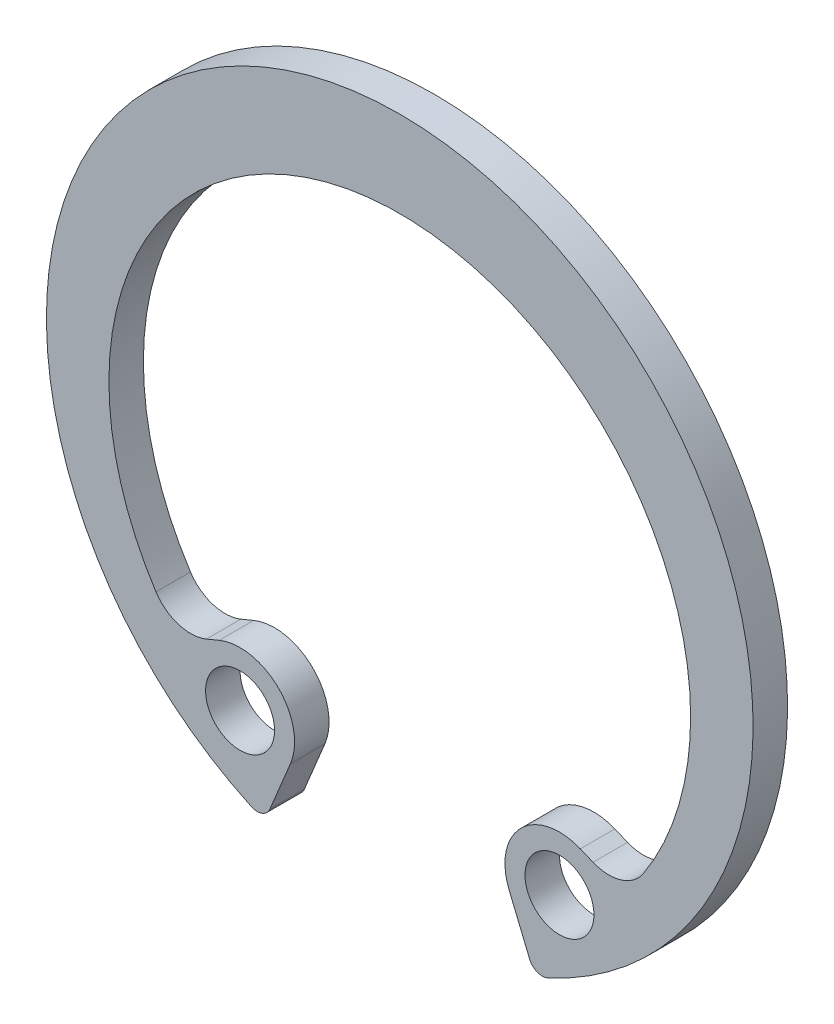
from build123d import *

# Parameters (mm, degrees)
BODYSKE_R      = 1
BASEBODY_DEPTH = 1
FILLET1_R      = 1.2
FILLET2_R      = 0.4


with BuildPart() as part:
    # BodySke → BaseBody (new body)
    with BuildSketch(Plane.XY):
        with BuildLine():
            Line((3.17163664, -7.657008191), (3.922505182, -9.469765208))
            ThreePointArc((3.922505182, -9.469765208), (0, 10.25), (-3.922505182, -9.469765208))
            Line((-3.922505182, -9.469765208), (-3.17163664, -7.657008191))
            ThreePointArc((-3.17163664, -7.657008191), (-3.514545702, -5.93308792), (-5.238465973, -5.590178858))
            Line((-5.238465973, -5.590178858), (-6.471844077, -6.101060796))
            ThreePointArc((-6.471844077, -6.101060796), (0, 7.75), (6.471844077, -6.101060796))
            Line((6.471844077, -6.101060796), (5.238465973, -5.590178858))
            ThreePointArc((5.238465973, -5.590178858), (3.514545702, -5.93308792), (3.17163664, -7.657008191))
        make_face()
        with Locations((4.633105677, -7.051647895)):
            Circle(BODYSKE_R, mode=Mode.SUBTRACT)
        with Locations((-4.633105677, -7.051647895)):
            Circle(BODYSKE_R, mode=Mode.SUBTRACT)
    extrude(amount=BASEBODY_DEPTH)

    # Fillet1
    fillet1_edges = [part.edges().sort_by_distance(p)[0] for p in [
        (6.471844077, -6.101060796, 0.5),
        (-6.471844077, -6.101060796, 0.5),
    ]]
    fillet(fillet1_edges, radius=FILLET1_R)

    # Fillet2
    fillet2_edges = [part.edges().sort_by_distance(p)[0] for p in [
        (-3.922505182, -9.469765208, 0.5),
        (3.922505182, -9.469765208, 0.5),
    ]]
    fillet(fillet2_edges, radius=FILLET2_R)


solid = part.part
